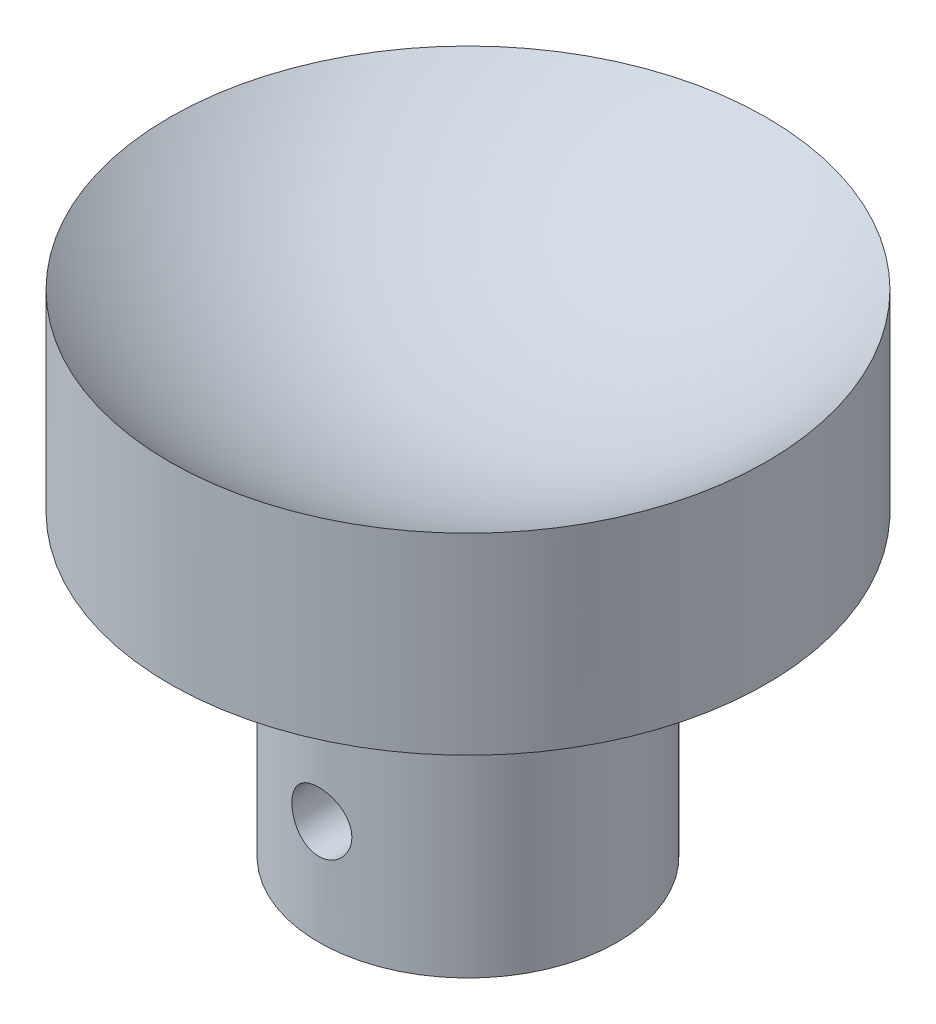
ISO-10303-21;
HEADER;
FILE_DESCRIPTION(('STEP AP214'),'2;1');
FILE_NAME('part.step','',(''),(''),'','','');
FILE_SCHEMA(('AUTOMOTIVE_DESIGN { 1 0 10303 214 1 1 1 1 }'));
ENDSEC;
DATA;
#1=APPLICATION_CONTEXT('core data for automotive mechanical design processes');
#2=APPLICATION_PROTOCOL_DEFINITION('international standard','automotive_design',2000,#1);
#3=PRODUCT_CONTEXT('',#1,'mechanical');
#4=PRODUCT('Part','Part','',(#3));
#5=PRODUCT_RELATED_PRODUCT_CATEGORY('part','',(#4));
#6=PRODUCT_DEFINITION_FORMATION('','',#4);
#7=PRODUCT_DEFINITION_CONTEXT('part definition',#1,'design');
#8=PRODUCT_DEFINITION('design','',#6,#7);
#9=PRODUCT_DEFINITION_SHAPE('','',#8);
#10=(LENGTH_UNIT() NAMED_UNIT(*) SI_UNIT(.MILLI.,.METRE.));
#11=(NAMED_UNIT(*) PLANE_ANGLE_UNIT() SI_UNIT($,.RADIAN.));
#12=(NAMED_UNIT(*) SI_UNIT($,.STERADIAN.) SOLID_ANGLE_UNIT());
#13=UNCERTAINTY_MEASURE_WITH_UNIT(LENGTH_MEASURE(1.E-05),#10,'distance_accuracy_value','');
#14=(GEOMETRIC_REPRESENTATION_CONTEXT(3) GLOBAL_UNCERTAINTY_ASSIGNED_CONTEXT((#13)) GLOBAL_UNIT_ASSIGNED_CONTEXT((#10,
#11,#12)) REPRESENTATION_CONTEXT('',''));
#15=CARTESIAN_POINT('',(0.,0.,0.));
#16=DIRECTION('',(0.,0.,1.));
#17=DIRECTION('',(1.,0.,0.));
#18=AXIS2_PLACEMENT_3D('',#15,#16,#17);
#19=CARTESIAN_POINT('',(0.,43.5513544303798,0.));
#20=DIRECTION('',(0.,1.,0.));
#21=DIRECTION('',(1.,0.,0.));
#22=AXIS2_PLACEMENT_3D('',#19,#20,#21);
#23=SPHERICAL_SURFACE('',#22,37.2013544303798);
#24=CARTESIAN_POINT('',(0.,16.3708325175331,0.));
#25=DIRECTION('',(0.,1.,0.));
#26=DIRECTION('',(-1.,0.,0.));
#27=AXIS2_PLACEMENT_3D('',#24,#25,#26);
#28=CIRCLE('',#27,25.4);
#29=CARTESIAN_POINT('',(-25.4,16.3708325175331,0.));
#30=VERTEX_POINT('',#29);
#31=EDGE_CURVE('E51',#30,#30,#28,.T.);
#32=ORIENTED_EDGE('',*,*,#31,.T.);
#33=EDGE_LOOP('',(#32));
#34=FACE_BOUND('',#33,.T.);
#35=ADVANCED_FACE('F40',(#34),#23,.F.);
#36=CARTESIAN_POINT('',(0.,0.,0.));
#37=DIRECTION('',(0.,1.,0.));
#38=DIRECTION('',(-1.,0.,0.));
#39=AXIS2_PLACEMENT_3D('',#36,#37,#38);
#40=CYLINDRICAL_SURFACE('',#39,25.4);
#41=ORIENTED_EDGE('',*,*,#31,.F.);
#42=EDGE_LOOP('',(#41));
#43=FACE_BOUND('',#42,.T.);
#44=CARTESIAN_POINT('',(0.,0.,0.));
#45=DIRECTION('',(0.,1.,0.));
#46=DIRECTION('',(-1.,0.,0.));
#47=AXIS2_PLACEMENT_3D('',#44,#45,#46);
#48=CIRCLE('',#47,25.4);
#49=CARTESIAN_POINT('',(-25.4,0.,0.));
#50=VERTEX_POINT('',#49);
#51=EDGE_CURVE('E55',#50,#50,#48,.T.);
#52=ORIENTED_EDGE('',*,*,#51,.T.);
#53=EDGE_LOOP('',(#52));
#54=FACE_BOUND('',#53,.T.);
#55=ADVANCED_FACE('F101',(#43,#54),#40,.T.);
#56=CARTESIAN_POINT('',(12.7,0.,0.));
#57=DIRECTION('',(0.,1.,0.));
#58=DIRECTION('',(-1.,0.,0.));
#59=AXIS2_PLACEMENT_3D('',#56,#57,#58);
#60=PLANE('',#59);
#61=ORIENTED_EDGE('',*,*,#51,.F.);
#62=EDGE_LOOP('',(#61));
#63=FACE_BOUND('',#62,.T.);
#64=CARTESIAN_POINT('',(0.,0.,0.));
#65=DIRECTION('',(0.,1.,0.));
#66=DIRECTION('',(-1.,0.,0.));
#67=AXIS2_PLACEMENT_3D('',#64,#65,#66);
#68=CIRCLE('',#67,12.7);
#69=CARTESIAN_POINT('',(-12.7,0.,0.));
#70=VERTEX_POINT('',#69);
#71=EDGE_CURVE('E112',#70,#70,#68,.T.);
#72=ORIENTED_EDGE('',*,*,#71,.T.);
#73=EDGE_LOOP('',(#72));
#74=FACE_BOUND('',#73,.T.);
#75=ADVANCED_FACE('F96',(#63,#74),#60,.F.);
#76=CARTESIAN_POINT('',(0.,0.,0.));
#77=DIRECTION('',(0.,1.,0.));
#78=DIRECTION('',(-1.,0.,0.));
#79=AXIS2_PLACEMENT_3D('',#76,#77,#78);
#80=CYLINDRICAL_SURFACE('',#79,12.7);
#81=CARTESIAN_POINT('',(2.55269999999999,-16.51,-12.4408087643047));
#82=CARTESIAN_POINT('',(2.55269477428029,-16.3681764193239,-12.4408115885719));
#83=CARTESIAN_POINT('',(2.54084064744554,-16.2262871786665,-12.4432602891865));
#84=CARTESIAN_POINT('',(2.49377749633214,-15.9465237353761,-12.4527759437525));
#85=CARTESIAN_POINT('',(2.45854987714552,-15.8086528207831,-12.459846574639));
#86=CARTESIAN_POINT('',(2.36587714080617,-15.5410139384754,-12.477773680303));
#87=CARTESIAN_POINT('',(2.30845423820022,-15.4112380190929,-12.4886263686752));
#88=CARTESIAN_POINT('',(2.1730819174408,-15.1631653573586,-12.5128902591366));
#89=CARTESIAN_POINT('',(2.09513360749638,-15.0448679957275,-12.5263013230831));
#90=CARTESIAN_POINT('',(1.91973643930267,-14.821415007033,-12.5543848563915));
#91=CARTESIAN_POINT('',(1.82205052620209,-14.7164471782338,-12.5690712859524));
#92=CARTESIAN_POINT('',(1.6104632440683,-14.5242726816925,-12.5979279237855));
#93=CARTESIAN_POINT('',(1.49656073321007,-14.4370672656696,-12.6120980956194));
#94=CARTESIAN_POINT('',(1.25452913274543,-14.2821635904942,-12.6384762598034));
#95=CARTESIAN_POINT('',(1.1262835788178,-14.2146439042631,-12.6506658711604));
#96=CARTESIAN_POINT('',(0.859982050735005,-14.1021807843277,-12.6715526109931));
#97=CARTESIAN_POINT('',(0.72192700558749,-14.0572352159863,-12.6802500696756));
#98=CARTESIAN_POINT('',(0.441874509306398,-13.991781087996,-12.69307390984));
#99=CARTESIAN_POINT('',(0.299953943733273,-13.9709553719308,-12.6972595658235));
#100=CARTESIAN_POINT('',(0.0145757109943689,-13.953342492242,-12.7007929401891));
#101=CARTESIAN_POINT('',(-0.128881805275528,-13.9565529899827,-12.7001411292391));
#102=CARTESIAN_POINT('',(-0.411081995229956,-13.9866810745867,-12.6941189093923));
#103=CARTESIAN_POINT('',(-0.549862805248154,-14.013257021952,-12.6888165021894));
#104=CARTESIAN_POINT('',(-0.820954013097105,-14.088819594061,-12.6741656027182));
#105=CARTESIAN_POINT('',(-0.953264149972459,-14.1378071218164,-12.6648169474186));
#106=CARTESIAN_POINT('',(-1.20863148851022,-14.257118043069,-12.6430120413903));
#107=CARTESIAN_POINT('',(-1.3316245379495,-14.3275750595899,-12.630536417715));
#108=CARTESIAN_POINT('',(-1.56416830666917,-14.4877260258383,-12.6038524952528));
#109=CARTESIAN_POINT('',(-1.67371746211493,-14.577422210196,-12.5896439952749));
#110=CARTESIAN_POINT('',(-1.87829141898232,-14.7753788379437,-12.5607682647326));
#111=CARTESIAN_POINT('',(-1.97302660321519,-14.8839382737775,-12.546097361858));
#112=CARTESIAN_POINT('',(-2.14299431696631,-15.1155516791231,-12.5181874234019));
#113=CARTESIAN_POINT('',(-2.21822647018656,-15.2386059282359,-12.5049484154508));
#114=CARTESIAN_POINT('',(-2.34715391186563,-15.4961345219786,-12.4813938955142));
#115=CARTESIAN_POINT('',(-2.40080191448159,-15.6306331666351,-12.4710848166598));
#116=CARTESIAN_POINT('',(-2.4846530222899,-15.9069906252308,-12.4546514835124));
#117=CARTESIAN_POINT('',(-2.51485921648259,-16.0488484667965,-12.4485266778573));
#118=CARTESIAN_POINT('',(-2.55053557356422,-16.3332714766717,-12.4412659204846));
#119=CARTESIAN_POINT('',(-2.55642414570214,-16.4757820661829,-12.4400455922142));
#120=CARTESIAN_POINT('',(-2.54442435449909,-16.7597492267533,-12.4425054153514));
#121=CARTESIAN_POINT('',(-2.5265373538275,-16.9012058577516,-12.4461852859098));
#122=CARTESIAN_POINT('',(-2.46785499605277,-17.1776406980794,-12.4579518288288));
#123=CARTESIAN_POINT('',(-2.42728355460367,-17.3126684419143,-12.4659954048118));
#124=CARTESIAN_POINT('',(-2.3246235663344,-17.5740098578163,-12.4855452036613));
#125=CARTESIAN_POINT('',(-2.26253323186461,-17.7003228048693,-12.4970517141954));
#126=CARTESIAN_POINT('',(-2.11765213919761,-17.9424788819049,-12.522420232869));
#127=CARTESIAN_POINT('',(-2.0345997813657,-18.0581624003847,-12.5363112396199));
#128=CARTESIAN_POINT('',(-1.85050057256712,-18.2741033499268,-12.5648041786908));
#129=CARTESIAN_POINT('',(-1.7494518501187,-18.3743591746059,-12.5794061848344));
#130=CARTESIAN_POINT('',(-1.53034922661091,-18.5581871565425,-12.6079499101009));
#131=CARTESIAN_POINT('',(-1.41205578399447,-18.6414762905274,-12.6218778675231));
#132=CARTESIAN_POINT('',(-1.16291237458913,-18.7869982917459,-12.6472641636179));
#133=CARTESIAN_POINT('',(-1.0320629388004,-18.8492320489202,-12.6587226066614));
#134=CARTESIAN_POINT('',(-0.762262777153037,-18.9504651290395,-12.677820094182));
#135=CARTESIAN_POINT('',(-0.623363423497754,-18.989597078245,-12.6854808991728));
#136=CARTESIAN_POINT('',(-0.340793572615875,-19.0439356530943,-12.6962133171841));
#137=CARTESIAN_POINT('',(-0.197123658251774,-19.0591451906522,-12.6992854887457));
#138=CARTESIAN_POINT('',(0.0882065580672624,-19.0650934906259,-12.7004811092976));
#139=CARTESIAN_POINT('',(0.229857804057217,-19.056257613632,-12.6986905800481));
#140=CARTESIAN_POINT('',(0.509612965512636,-19.0153057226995,-12.69054302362));
#141=CARTESIAN_POINT('',(0.647716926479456,-18.9831900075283,-12.6841860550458));
#142=CARTESIAN_POINT('',(0.916188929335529,-18.8967799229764,-12.6676225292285));
#143=CARTESIAN_POINT('',(1.04657416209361,-18.8425371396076,-12.6574249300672));
#144=CARTESIAN_POINT('',(1.29645345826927,-18.7134666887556,-12.6342776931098));
#145=CARTESIAN_POINT('',(1.41594664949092,-18.6386373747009,-12.6213278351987));
#146=CARTESIAN_POINT('',(1.64275163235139,-18.4690856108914,-12.5938336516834));
#147=CARTESIAN_POINT('',(1.74983342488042,-18.3740591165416,-12.5792667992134));
#148=CARTESIAN_POINT('',(1.94667730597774,-18.1674345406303,-12.5503135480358));
#149=CARTESIAN_POINT('',(2.03643528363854,-18.0558325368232,-12.5359271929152));
#150=CARTESIAN_POINT('',(2.19701377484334,-17.8177653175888,-12.5087910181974));
#151=CARTESIAN_POINT('',(2.26761719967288,-17.6911513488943,-12.4960607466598));
#152=CARTESIAN_POINT('',(2.38643481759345,-17.4276361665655,-12.4739172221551));
#153=CARTESIAN_POINT('',(2.43466925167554,-17.2907443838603,-12.4645009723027));
#154=CARTESIAN_POINT('',(2.49806438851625,-17.0462927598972,-12.4519241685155));
#155=CARTESIAN_POINT('',(2.51851594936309,-16.9401238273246,-12.447781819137));
#156=CARTESIAN_POINT('',(2.54583550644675,-16.7259825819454,-12.4422230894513));
#157=CARTESIAN_POINT('',(2.55270397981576,-16.6180103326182,-12.4408066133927));
#158=CARTESIAN_POINT('',(2.55269999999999,-16.51,-12.4408087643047));
#159=B_SPLINE_CURVE_WITH_KNOTS('',3,(#81,#82,#83,#84,#85,#86,#87,#88,#89,#90,#91,#92,#93,#94,
#95,#96,#97,#98,#99,#100,#101,#102,#103,#104,#105,#106,#107,#108,#109,#110,#111,#112,#113,#114,
#115,#116,#117,#118,#119,#120,#121,#122,#123,#124,#125,#126,#127,#128,#129,#130,#131,#132,#133,
#134,#135,#136,#137,#138,#139,#140,#141,#142,#143,#144,#145,#146,#147,#148,#149,#150,#151,#152,
#153,#154,#155,#156,#157,#158),.UNSPECIFIED.,.T.,.F.,(4,2,2,2,2,2,2,2,2,2,2,2,2,2,2,2,2,2,2,2,2,
2,2,2,2,2,2,2,2,2,2,2,2,2,2,2,2,2,4),(0.,0.425075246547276,0.850489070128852,1.27547820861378,
1.70044440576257,2.13085548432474,2.56129688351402,2.9955293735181,3.42972079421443,
3.85813570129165,4.28650892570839,4.70872092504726,5.13094993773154,5.55586246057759,
5.98082436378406,6.41326685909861,6.84571769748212,7.27911084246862,7.71244686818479,
8.13829502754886,8.56411878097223,8.98581164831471,9.40753955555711,9.83481596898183,
10.2621368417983,10.6960885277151,11.1300218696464,11.5614391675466,11.9928039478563,
12.4165877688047,12.8403661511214,13.2631621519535,13.6859919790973,14.1157058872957,
14.5455216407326,14.9800225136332,15.4141294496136,15.7378706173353,16.061600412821),.UNSPECIFIED.);
#160=CARTESIAN_POINT('',(2.55269999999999,-16.51,-12.4408087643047));
#161=VERTEX_POINT('',#160);
#162=EDGE_CURVE('E43',#161,#161,#159,.T.);
#163=ORIENTED_EDGE('',*,*,#162,.T.);
#164=EDGE_LOOP('',(#163));
#165=FACE_BOUND('',#164,.T.);
#166=CARTESIAN_POINT('',(2.55269999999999,-16.51,12.4408087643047));
#167=CARTESIAN_POINT('',(2.55269477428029,-16.6518235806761,12.4408115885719));
#168=CARTESIAN_POINT('',(2.54084064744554,-16.7937128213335,12.4432602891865));
#169=CARTESIAN_POINT('',(2.49377749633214,-17.0734762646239,12.4527759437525));
#170=CARTESIAN_POINT('',(2.45854987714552,-17.2113471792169,12.459846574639));
#171=CARTESIAN_POINT('',(2.36587714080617,-17.4789860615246,12.477773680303));
#172=CARTESIAN_POINT('',(2.30845423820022,-17.6087619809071,12.4886263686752));
#173=CARTESIAN_POINT('',(2.1730819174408,-17.8568346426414,12.5128902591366));
#174=CARTESIAN_POINT('',(2.09513360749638,-17.9751320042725,12.5263013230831));
#175=CARTESIAN_POINT('',(1.91973643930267,-18.198584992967,12.5543848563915));
#176=CARTESIAN_POINT('',(1.82205052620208,-18.3035528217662,12.5690712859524));
#177=CARTESIAN_POINT('',(1.6104632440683,-18.4957273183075,12.5979279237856));
#178=CARTESIAN_POINT('',(1.49656073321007,-18.5829327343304,12.6120980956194));
#179=CARTESIAN_POINT('',(1.25452913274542,-18.7378364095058,12.6384762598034));
#180=CARTESIAN_POINT('',(1.1262835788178,-18.8053560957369,12.6506658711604));
#181=CARTESIAN_POINT('',(0.859982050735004,-18.9178192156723,12.6715526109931));
#182=CARTESIAN_POINT('',(0.721927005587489,-18.9627647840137,12.6802500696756));
#183=CARTESIAN_POINT('',(0.441874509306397,-19.028218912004,12.69307390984));
#184=CARTESIAN_POINT('',(0.299953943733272,-19.0490446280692,12.6972595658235));
#185=CARTESIAN_POINT('',(0.0145757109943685,-19.066657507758,12.7007929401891));
#186=CARTESIAN_POINT('',(-0.128881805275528,-19.0634470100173,12.7001411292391));
#187=CARTESIAN_POINT('',(-0.411081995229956,-19.0333189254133,12.6941189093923));
#188=CARTESIAN_POINT('',(-0.549862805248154,-19.006742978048,12.6888165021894));
#189=CARTESIAN_POINT('',(-0.820954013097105,-18.931180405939,12.6741656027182));
#190=CARTESIAN_POINT('',(-0.953264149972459,-18.8821928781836,12.6648169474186));
#191=CARTESIAN_POINT('',(-1.20863148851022,-18.762881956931,12.6430120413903));
#192=CARTESIAN_POINT('',(-1.3316245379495,-18.6924249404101,12.630536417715));
#193=CARTESIAN_POINT('',(-1.56416830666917,-18.5322739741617,12.6038524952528));
#194=CARTESIAN_POINT('',(-1.67371746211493,-18.442577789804,12.5896439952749));
#195=CARTESIAN_POINT('',(-1.87829141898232,-18.2446211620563,12.5607682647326));
#196=CARTESIAN_POINT('',(-1.97302660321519,-18.1360617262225,12.546097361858));
#197=CARTESIAN_POINT('',(-2.1429943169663,-17.9044483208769,12.5181874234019));
#198=CARTESIAN_POINT('',(-2.21822647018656,-17.7813940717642,12.5049484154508));
#199=CARTESIAN_POINT('',(-2.34715391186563,-17.5238654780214,12.4813938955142));
#200=CARTESIAN_POINT('',(-2.40080191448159,-17.3893668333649,12.4710848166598));
#201=CARTESIAN_POINT('',(-2.4846530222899,-17.1130093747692,12.4546514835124));
#202=CARTESIAN_POINT('',(-2.51485921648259,-16.9711515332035,12.4485266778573));
#203=CARTESIAN_POINT('',(-2.55053557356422,-16.6867285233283,12.4412659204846));
#204=CARTESIAN_POINT('',(-2.55642414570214,-16.5442179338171,12.4400455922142));
#205=CARTESIAN_POINT('',(-2.54442435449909,-16.2602507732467,12.4425054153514));
#206=CARTESIAN_POINT('',(-2.5265373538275,-16.1187941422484,12.4461852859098));
#207=CARTESIAN_POINT('',(-2.46785499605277,-15.8423593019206,12.4579518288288));
#208=CARTESIAN_POINT('',(-2.42728355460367,-15.7073315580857,12.4659954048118));
#209=CARTESIAN_POINT('',(-2.3246235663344,-15.4459901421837,12.4855452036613));
#210=CARTESIAN_POINT('',(-2.26253323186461,-15.3196771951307,12.4970517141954));
#211=CARTESIAN_POINT('',(-2.11765213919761,-15.0775211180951,12.522420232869));
#212=CARTESIAN_POINT('',(-2.0345997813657,-14.9618375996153,12.5363112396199));
#213=CARTESIAN_POINT('',(-1.85050057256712,-14.7458966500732,12.5648041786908));
#214=CARTESIAN_POINT('',(-1.7494518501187,-14.6456408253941,12.5794061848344));
#215=CARTESIAN_POINT('',(-1.53034922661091,-14.4618128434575,12.6079499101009));
#216=CARTESIAN_POINT('',(-1.41205578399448,-14.3785237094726,12.6218778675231));
#217=CARTESIAN_POINT('',(-1.16291237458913,-14.2330017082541,12.6472641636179));
#218=CARTESIAN_POINT('',(-1.0320629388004,-14.1707679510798,12.6587226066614));
#219=CARTESIAN_POINT('',(-0.762262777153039,-14.0695348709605,12.677820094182));
#220=CARTESIAN_POINT('',(-0.623363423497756,-14.030402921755,12.6854808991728));
#221=CARTESIAN_POINT('',(-0.340793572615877,-13.9760643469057,12.6962133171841));
#222=CARTESIAN_POINT('',(-0.197123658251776,-13.9608548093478,12.6992854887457));
#223=CARTESIAN_POINT('',(0.0882065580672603,-13.9549065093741,12.7004811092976));
#224=CARTESIAN_POINT('',(0.229857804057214,-13.963742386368,12.6986905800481));
#225=CARTESIAN_POINT('',(0.509612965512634,-14.0046942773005,12.69054302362));
#226=CARTESIAN_POINT('',(0.647716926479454,-14.0368099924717,12.6841860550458));
#227=CARTESIAN_POINT('',(0.916188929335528,-14.1232200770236,12.6676225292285));
#228=CARTESIAN_POINT('',(1.04657416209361,-14.1774628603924,12.6574249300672));
#229=CARTESIAN_POINT('',(1.29645345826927,-14.3065333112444,12.6342776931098));
#230=CARTESIAN_POINT('',(1.41594664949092,-14.3813626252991,12.6213278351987));
#231=CARTESIAN_POINT('',(1.64275163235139,-14.5509143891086,12.5938336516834));
#232=CARTESIAN_POINT('',(1.74983342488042,-14.6459408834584,12.5792667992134));
#233=CARTESIAN_POINT('',(1.94667730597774,-14.8525654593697,12.5503135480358));
#234=CARTESIAN_POINT('',(2.03643528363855,-14.9641674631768,12.5359271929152));
#235=CARTESIAN_POINT('',(2.19701377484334,-15.2022346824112,12.5087910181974));
#236=CARTESIAN_POINT('',(2.26761719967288,-15.3288486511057,12.4960607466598));
#237=CARTESIAN_POINT('',(2.38643481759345,-15.5923638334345,12.4739172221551));
#238=CARTESIAN_POINT('',(2.43466925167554,-15.7292556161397,12.4645009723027));
#239=CARTESIAN_POINT('',(2.49806438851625,-15.9737072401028,12.4519241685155));
#240=CARTESIAN_POINT('',(2.51851594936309,-16.0798761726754,12.447781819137));
#241=CARTESIAN_POINT('',(2.54583550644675,-16.2940174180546,12.4422230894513));
#242=CARTESIAN_POINT('',(2.55270397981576,-16.4019896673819,12.4408066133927));
#243=CARTESIAN_POINT('',(2.55269999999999,-16.51,12.4408087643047));
#244=B_SPLINE_CURVE_WITH_KNOTS('',3,(#166,#167,#168,#169,#170,#171,#172,#173,#174,#175,#176,
#177,#178,#179,#180,#181,#182,#183,#184,#185,#186,#187,#188,#189,#190,#191,#192,#193,#194,#195,
#196,#197,#198,#199,#200,#201,#202,#203,#204,#205,#206,#207,#208,#209,#210,#211,#212,#213,#214,
#215,#216,#217,#218,#219,#220,#221,#222,#223,#224,#225,#226,#227,#228,#229,#230,#231,#232,#233,
#234,#235,#236,#237,#238,#239,#240,#241,#242,#243),.UNSPECIFIED.,.T.,.F.,(4,2,2,2,2,2,2,2,2,2,2,
2,2,2,2,2,2,2,2,2,2,2,2,2,2,2,2,2,2,2,2,2,2,2,2,2,2,2,4),(0.,0.425075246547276,
0.850489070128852,1.27547820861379,1.70044440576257,2.13085548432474,2.56129688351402,
2.9955293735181,3.42972079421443,3.85813570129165,4.28650892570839,4.70872092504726,
5.13094993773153,5.55586246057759,5.98082436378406,6.41326685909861,6.84571769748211,
7.27911084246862,7.71244686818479,8.13829502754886,8.56411878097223,8.98581164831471,
9.40753955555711,9.83481596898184,10.2621368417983,10.6960885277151,11.1300218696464,
11.5614391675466,11.9928039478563,12.4165877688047,12.8403661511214,13.2631621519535,
13.6859919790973,14.1157058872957,14.5455216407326,14.9800225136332,15.4141294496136,
15.7378706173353,16.061600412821),.UNSPECIFIED.);
#245=CARTESIAN_POINT('',(2.55269999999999,-16.51,12.4408087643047));
#246=VERTEX_POINT('',#245);
#247=EDGE_CURVE('E12',#246,#246,#244,.T.);
#248=ORIENTED_EDGE('',*,*,#247,.T.);
#249=EDGE_LOOP('',(#248));
#250=FACE_BOUND('',#249,.T.);
#251=ORIENTED_EDGE('',*,*,#71,.F.);
#252=EDGE_LOOP('',(#251));
#253=FACE_BOUND('',#252,.T.);
#254=CARTESIAN_POINT('',(0.,-25.4,0.));
#255=DIRECTION('',(0.,1.,0.));
#256=DIRECTION('',(-1.,0.,0.));
#257=AXIS2_PLACEMENT_3D('',#254,#255,#256);
#258=CIRCLE('',#257,12.7);
#259=CARTESIAN_POINT('',(-12.7,-25.4,0.));
#260=VERTEX_POINT('',#259);
#261=EDGE_CURVE('E114',#260,#260,#258,.T.);
#262=ORIENTED_EDGE('',*,*,#261,.T.);
#263=EDGE_LOOP('',(#262));
#264=FACE_BOUND('',#263,.T.);
#265=ADVANCED_FACE('F60',(#165,#250,#253,#264),#80,.T.);
#266=CARTESIAN_POINT('',(0.,-25.4,0.));
#267=DIRECTION('',(0.,1.,0.));
#268=DIRECTION('',(-1.,0.,0.));
#269=AXIS2_PLACEMENT_3D('',#266,#267,#268);
#270=PLANE('',#269);
#271=CARTESIAN_POINT('',(0.,-25.4,0.));
#272=DIRECTION('',(0.,-1.,0.));
#273=DIRECTION('',(1.,0.,0.));
#274=AXIS2_PLACEMENT_3D('',#271,#272,#273);
#275=CIRCLE('',#274,7.14375);
#276=CARTESIAN_POINT('',(7.14375,-25.4,0.));
#277=VERTEX_POINT('',#276);
#278=EDGE_CURVE('E120',#277,#277,#275,.T.);
#279=ORIENTED_EDGE('',*,*,#278,.F.);
#280=EDGE_LOOP('',(#279));
#281=FACE_BOUND('',#280,.T.);
#282=ORIENTED_EDGE('',*,*,#261,.F.);
#283=EDGE_LOOP('',(#282));
#284=FACE_BOUND('',#283,.T.);
#285=ADVANCED_FACE('F88',(#281,#284),#270,.F.);
#286=CARTESIAN_POINT('',(0.,-10.16,0.));
#287=DIRECTION('',(0.,-1.,0.));
#288=DIRECTION('',(1.,0.,0.));
#289=AXIS2_PLACEMENT_3D('',#286,#287,#288);
#290=CYLINDRICAL_SURFACE('',#289,7.14375);
#291=CARTESIAN_POINT('',(2.55269999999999,-16.51,-6.67209762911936));
#292=CARTESIAN_POINT('',(2.55270301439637,-16.6483785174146,-6.67209498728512));
#293=CARTESIAN_POINT('',(2.54141029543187,-16.7867362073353,-6.67644946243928));
#294=CARTESIAN_POINT('',(2.49671976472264,-17.059311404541,-6.69328882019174));
#295=CARTESIAN_POINT('',(2.46332088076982,-17.1935287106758,-6.7057740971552));
#296=CARTESIAN_POINT('',(2.37577435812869,-17.4538208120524,-6.73728409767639));
#297=CARTESIAN_POINT('',(2.32167239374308,-17.5799128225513,-6.75629441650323));
#298=CARTESIAN_POINT('',(2.1944149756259,-17.8212768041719,-6.79869031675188));
#299=CARTESIAN_POINT('',(2.12125440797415,-17.9365458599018,-6.82207707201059));
#300=CARTESIAN_POINT('',(1.95442617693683,-18.1581846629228,-6.8717717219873));
#301=CARTESIAN_POINT('',(1.86004160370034,-18.2639969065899,-6.89816000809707));
#302=CARTESIAN_POINT('',(1.65496957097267,-18.4586785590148,-6.95021002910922));
#303=CARTESIAN_POINT('',(1.5442790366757,-18.5475447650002,-6.97587162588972));
#304=CARTESIAN_POINT('',(1.30557329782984,-18.708428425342,-7.02452157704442));
#305=CARTESIAN_POINT('',(1.17713271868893,-18.779849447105,-7.04740454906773));
#306=CARTESIAN_POINT('',(0.909099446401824,-18.8998441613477,-7.08696107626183));
#307=CARTESIAN_POINT('',(0.769510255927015,-18.9484249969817,-7.10363657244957));
#308=CARTESIAN_POINT('',(0.48899658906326,-19.0194335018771,-7.12832918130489));
#309=CARTESIAN_POINT('',(0.348342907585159,-19.0428188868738,-7.13666243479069));
#310=CARTESIAN_POINT('',(0.0648772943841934,-19.0658310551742,-7.14486077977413));
#311=CARTESIAN_POINT('',(-0.0779339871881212,-19.0654648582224,-7.14472837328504));
#312=CARTESIAN_POINT('',(-0.354834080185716,-19.0415638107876,-7.13621719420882));
#313=CARTESIAN_POINT('',(-0.489026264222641,-19.0190719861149,-7.12820966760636));
#314=CARTESIAN_POINT('',(-0.751588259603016,-18.953299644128,-7.10532579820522));
#315=CARTESIAN_POINT('',(-0.879957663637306,-18.9100176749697,-7.09044897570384));
#316=CARTESIAN_POINT('',(-1.12935941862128,-18.8033561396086,-7.05505577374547));
#317=CARTESIAN_POINT('',(-1.25026357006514,-18.7397031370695,-7.03446320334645));
#318=CARTESIAN_POINT('',(-1.47996281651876,-18.5943405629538,-6.98974872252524));
#319=CARTESIAN_POINT('',(-1.58875420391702,-18.512625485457,-6.96562573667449));
#320=CARTESIAN_POINT('',(-1.79731427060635,-18.3283301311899,-6.91483638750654));
#321=CARTESIAN_POINT('',(-1.89628723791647,-18.224866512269,-6.88810300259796));
#322=CARTESIAN_POINT('',(-2.07575926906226,-18.0026178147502,-6.83616392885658));
#323=CARTESIAN_POINT('',(-2.15625453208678,-17.8838295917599,-6.81095855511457));
#324=CARTESIAN_POINT('',(-2.29781749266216,-17.6314375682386,-6.76453043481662));
#325=CARTESIAN_POINT('',(-2.35849780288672,-17.4976001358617,-6.74339008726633));
#326=CARTESIAN_POINT('',(-2.45617122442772,-17.220655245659,-6.7084357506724));
#327=CARTESIAN_POINT('',(-2.49317606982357,-17.0775524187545,-6.69461813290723));
#328=CARTESIAN_POINT('',(-2.54072176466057,-16.7939391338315,-6.67671426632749));
#329=CARTESIAN_POINT('',(-2.55251394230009,-16.6536675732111,-6.67216842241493));
#330=CARTESIAN_POINT('',(-2.55288156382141,-16.3731066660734,-6.67202855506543));
#331=CARTESIAN_POINT('',(-2.54146207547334,-16.2328173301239,-6.67643257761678));
#332=CARTESIAN_POINT('',(-2.49686106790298,-15.9622938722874,-6.69323306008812));
#333=CARTESIAN_POINT('',(-2.46460274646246,-15.8318841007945,-6.70529009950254));
#334=CARTESIAN_POINT('',(-2.38037760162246,-15.5783722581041,-6.73564817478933));
#335=CARTESIAN_POINT('',(-2.32840697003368,-15.4552716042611,-6.75395041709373));
#336=CARTESIAN_POINT('',(-2.20416960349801,-15.2150729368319,-6.79552963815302));
#337=CARTESIAN_POINT('',(-2.13125428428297,-15.0983374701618,-6.818958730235));
#338=CARTESIAN_POINT('',(-1.9679065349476,-14.8783108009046,-6.86787935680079));
#339=CARTESIAN_POINT('',(-1.8774682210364,-14.7750241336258,-6.89337158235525));
#340=CARTESIAN_POINT('',(-1.67557640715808,-14.5787731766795,-6.94529022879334));
#341=CARTESIAN_POINT('',(-1.56322329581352,-14.4867237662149,-6.9716878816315));
#342=CARTESIAN_POINT('',(-1.32401351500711,-14.3226975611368,-7.02104308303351));
#343=CARTESIAN_POINT('',(-1.19715708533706,-14.2507204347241,-7.04400068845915));
#344=CARTESIAN_POINT('',(-0.932900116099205,-14.1294556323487,-7.08382693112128));
#345=CARTESIAN_POINT('',(-0.795556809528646,-14.0800538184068,-7.10072610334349));
#346=CARTESIAN_POINT('',(-0.513776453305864,-14.0052977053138,-7.1266525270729));
#347=CARTESIAN_POINT('',(-0.369342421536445,-13.97993326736,-7.13568309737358));
#348=CARTESIAN_POINT('',(-0.0857906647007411,-13.9549882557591,-7.1445679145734));
#349=CARTESIAN_POINT('',(0.0531988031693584,-13.9541025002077,-7.14488665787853));
#350=CARTESIAN_POINT('',(0.329255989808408,-13.9748428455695,-7.13749355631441));
#351=CARTESIAN_POINT('',(0.466323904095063,-13.9964666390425,-7.1297825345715));
#352=CARTESIAN_POINT('',(0.731816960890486,-14.060714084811,-7.10739139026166));
#353=CARTESIAN_POINT('',(0.860361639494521,-14.102898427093,-7.09285728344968));
#354=CARTESIAN_POINT('',(1.10857796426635,-14.2066466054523,-7.05832404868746));
#355=CARTESIAN_POINT('',(1.22824794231,-14.2682140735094,-7.03832389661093));
#356=CARTESIAN_POINT('',(1.46055943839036,-14.411802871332,-6.99388881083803));
#357=CARTESIAN_POINT('',(1.57272716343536,-14.4945449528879,-6.96930828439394));
#358=CARTESIAN_POINT('',(1.78200020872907,-14.6769600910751,-6.9187607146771));
#359=CARTESIAN_POINT('',(1.87910035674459,-14.7766389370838,-6.89279319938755));
#360=CARTESIAN_POINT('',(2.06013138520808,-14.9956535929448,-6.84092913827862));
#361=CARTESIAN_POINT('',(2.14323420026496,-15.1156905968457,-6.81509268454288));
#362=CARTESIAN_POINT('',(2.28807806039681,-15.368844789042,-6.76784248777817));
#363=CARTESIAN_POINT('',(2.34982051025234,-15.5019611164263,-6.74642845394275));
#364=CARTESIAN_POINT('',(2.45002781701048,-15.7783361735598,-6.71069280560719));
#365=CARTESIAN_POINT('',(2.48838551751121,-15.9216382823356,-6.69640389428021));
#366=CARTESIAN_POINT('',(2.53971360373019,-16.2133032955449,-6.67711005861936));
#367=CARTESIAN_POINT('',(2.55269676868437,-16.361663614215,-6.67210046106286));
#368=CARTESIAN_POINT('',(2.55269999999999,-16.51,-6.67209762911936));
#369=B_SPLINE_CURVE_WITH_KNOTS('',3,(#291,#292,#293,#294,#295,#296,#297,#298,#299,#300,#301,
#302,#303,#304,#305,#306,#307,#308,#309,#310,#311,#312,#313,#314,#315,#316,#317,#318,#319,#320,
#321,#322,#323,#324,#325,#326,#327,#328,#329,#330,#331,#332,#333,#334,#335,#336,#337,#338,#339,
#340,#341,#342,#343,#344,#345,#346,#347,#348,#349,#350,#351,#352,#353,#354,#355,#356,#357,#358,
#359,#360,#361,#362,#363,#364,#365,#366,#367,#368),.UNSPECIFIED.,.T.,.F.,(4,2,2,2,2,2,2,2,2,2,2,
2,2,2,2,2,2,2,2,2,2,2,2,2,2,2,2,2,2,2,2,2,2,2,2,2,2,2,4),(0.,0.414584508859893,
0.829189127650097,1.24288428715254,1.65669056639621,2.08743729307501,2.51826534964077,
2.96223129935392,3.40605830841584,3.83234492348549,4.25850555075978,4.66549455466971,
5.07251198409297,5.48523958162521,5.89809316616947,6.33306655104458,6.76812932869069,
7.21124907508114,7.65414903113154,8.07450180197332,8.49476280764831,8.89757546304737,
9.30046597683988,9.71750325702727,10.1346808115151,10.5754658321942,11.0162435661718,
11.4547674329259,11.8931062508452,12.3080253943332,12.7229020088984,13.1292788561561,
13.5357318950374,13.9584719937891,14.3813568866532,14.824015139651,15.2666442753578,
15.7112867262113,16.1557051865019),.UNSPECIFIED.);
#370=CARTESIAN_POINT('',(2.55269999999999,-16.51,-6.67209762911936));
#371=VERTEX_POINT('',#370);
#372=EDGE_CURVE('E81',#371,#371,#369,.T.);
#373=ORIENTED_EDGE('',*,*,#372,.T.);
#374=EDGE_LOOP('',(#373));
#375=FACE_BOUND('',#374,.T.);
#376=CARTESIAN_POINT('',(2.55269999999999,-16.51,6.67209762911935));
#377=CARTESIAN_POINT('',(2.55270301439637,-16.3716214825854,6.67209498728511));
#378=CARTESIAN_POINT('',(2.54141029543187,-16.2332637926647,6.67644946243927));
#379=CARTESIAN_POINT('',(2.49671976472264,-15.960688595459,6.69328882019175));
#380=CARTESIAN_POINT('',(2.46332088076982,-15.8264712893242,6.7057740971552));
#381=CARTESIAN_POINT('',(2.37577435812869,-15.5661791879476,6.73728409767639));
#382=CARTESIAN_POINT('',(2.32167239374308,-15.4400871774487,6.75629441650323));
#383=CARTESIAN_POINT('',(2.1944149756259,-15.1987231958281,6.79869031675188));
#384=CARTESIAN_POINT('',(2.12125440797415,-15.0834541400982,6.82207707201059));
#385=CARTESIAN_POINT('',(1.95442617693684,-14.8618153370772,6.8717717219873));
#386=CARTESIAN_POINT('',(1.86004160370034,-14.7560030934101,6.89816000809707));
#387=CARTESIAN_POINT('',(1.65496957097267,-14.5613214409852,6.95021002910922));
#388=CARTESIAN_POINT('',(1.5442790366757,-14.4724552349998,6.97587162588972));
#389=CARTESIAN_POINT('',(1.30557329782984,-14.311571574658,7.02452157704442));
#390=CARTESIAN_POINT('',(1.17713271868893,-14.240150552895,7.04740454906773));
#391=CARTESIAN_POINT('',(0.909099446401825,-14.1201558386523,7.08696107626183));
#392=CARTESIAN_POINT('',(0.769510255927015,-14.0715750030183,7.10363657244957));
#393=CARTESIAN_POINT('',(0.48899658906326,-14.0005664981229,7.12832918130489));
#394=CARTESIAN_POINT('',(0.348342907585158,-13.9771811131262,7.13666243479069));
#395=CARTESIAN_POINT('',(0.0648772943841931,-13.9541689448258,7.14486077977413));
#396=CARTESIAN_POINT('',(-0.0779339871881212,-13.9545351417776,7.14472837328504));
#397=CARTESIAN_POINT('',(-0.354834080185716,-13.9784361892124,7.13621719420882));
#398=CARTESIAN_POINT('',(-0.489026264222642,-14.0009280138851,7.12820966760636));
#399=CARTESIAN_POINT('',(-0.751588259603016,-14.066700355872,7.10532579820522));
#400=CARTESIAN_POINT('',(-0.879957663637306,-14.1099823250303,7.09044897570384));
#401=CARTESIAN_POINT('',(-1.12935941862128,-14.2166438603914,7.05505577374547));
#402=CARTESIAN_POINT('',(-1.25026357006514,-14.2802968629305,7.03446320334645));
#403=CARTESIAN_POINT('',(-1.47996281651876,-14.4256594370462,6.98974872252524));
#404=CARTESIAN_POINT('',(-1.58875420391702,-14.507374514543,6.96562573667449));
#405=CARTESIAN_POINT('',(-1.79731427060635,-14.6916698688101,6.91483638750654));
#406=CARTESIAN_POINT('',(-1.89628723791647,-14.795133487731,6.88810300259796));
#407=CARTESIAN_POINT('',(-2.07575926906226,-15.0173821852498,6.83616392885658));
#408=CARTESIAN_POINT('',(-2.15625453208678,-15.1361704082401,6.81095855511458));
#409=CARTESIAN_POINT('',(-2.29781749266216,-15.3885624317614,6.76453043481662));
#410=CARTESIAN_POINT('',(-2.35849780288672,-15.5223998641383,6.74339008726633));
#411=CARTESIAN_POINT('',(-2.45617122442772,-15.799344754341,6.7084357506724));
#412=CARTESIAN_POINT('',(-2.49317606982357,-15.9424475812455,6.69461813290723));
#413=CARTESIAN_POINT('',(-2.54072176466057,-16.2260608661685,6.67671426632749));
#414=CARTESIAN_POINT('',(-2.55251394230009,-16.3663324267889,6.67216842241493));
#415=CARTESIAN_POINT('',(-2.55288156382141,-16.6468933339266,6.67202855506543));
#416=CARTESIAN_POINT('',(-2.54146207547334,-16.7871826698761,6.67643257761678));
#417=CARTESIAN_POINT('',(-2.49686106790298,-17.0577061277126,6.69323306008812));
#418=CARTESIAN_POINT('',(-2.46460274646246,-17.1881158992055,6.70529009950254));
#419=CARTESIAN_POINT('',(-2.38037760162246,-17.4416277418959,6.73564817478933));
#420=CARTESIAN_POINT('',(-2.32840697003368,-17.5647283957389,6.75395041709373));
#421=CARTESIAN_POINT('',(-2.20416960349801,-17.8049270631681,6.79552963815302));
#422=CARTESIAN_POINT('',(-2.13125428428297,-17.9216625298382,6.818958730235));
#423=CARTESIAN_POINT('',(-1.9679065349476,-18.1416891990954,6.86787935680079));
#424=CARTESIAN_POINT('',(-1.8774682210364,-18.2449758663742,6.89337158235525));
#425=CARTESIAN_POINT('',(-1.67557640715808,-18.4412268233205,6.94529022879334));
#426=CARTESIAN_POINT('',(-1.56322329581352,-18.5332762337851,6.9716878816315));
#427=CARTESIAN_POINT('',(-1.32401351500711,-18.6973024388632,7.02104308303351));
#428=CARTESIAN_POINT('',(-1.19715708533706,-18.7692795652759,7.04400068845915));
#429=CARTESIAN_POINT('',(-0.932900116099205,-18.8905443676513,7.08382693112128));
#430=CARTESIAN_POINT('',(-0.795556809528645,-18.9399461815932,7.10072610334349));
#431=CARTESIAN_POINT('',(-0.513776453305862,-19.0147022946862,7.1266525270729));
#432=CARTESIAN_POINT('',(-0.369342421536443,-19.04006673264,7.13568309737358));
#433=CARTESIAN_POINT('',(-0.0857906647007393,-19.0650117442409,7.1445679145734));
#434=CARTESIAN_POINT('',(0.0531988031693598,-19.0658974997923,7.14488665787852));
#435=CARTESIAN_POINT('',(0.329255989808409,-19.0451571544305,7.13749355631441));
#436=CARTESIAN_POINT('',(0.466323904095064,-19.0235333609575,7.1297825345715));
#437=CARTESIAN_POINT('',(0.731816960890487,-18.959285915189,7.10739139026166));
#438=CARTESIAN_POINT('',(0.860361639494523,-18.917101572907,7.09285728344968));
#439=CARTESIAN_POINT('',(1.10857796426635,-18.8133533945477,7.05832404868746));
#440=CARTESIAN_POINT('',(1.22824794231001,-18.7517859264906,7.03832389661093));
#441=CARTESIAN_POINT('',(1.46055943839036,-18.608197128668,6.99388881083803));
#442=CARTESIAN_POINT('',(1.57272716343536,-18.5254550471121,6.96930828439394));
#443=CARTESIAN_POINT('',(1.78200020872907,-18.3430399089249,6.9187607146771));
#444=CARTESIAN_POINT('',(1.87910035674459,-18.2433610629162,6.89279319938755));
#445=CARTESIAN_POINT('',(2.06013138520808,-18.0243464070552,6.84092913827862));
#446=CARTESIAN_POINT('',(2.14323420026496,-17.9043094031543,6.81509268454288));
#447=CARTESIAN_POINT('',(2.28807806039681,-17.651155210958,6.76784248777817));
#448=CARTESIAN_POINT('',(2.34982051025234,-17.5180388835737,6.74642845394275));
#449=CARTESIAN_POINT('',(2.45002781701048,-17.2416638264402,6.71069280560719));
#450=CARTESIAN_POINT('',(2.48838551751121,-17.0983617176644,6.69640389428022));
#451=CARTESIAN_POINT('',(2.53971360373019,-16.8066967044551,6.67711005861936));
#452=CARTESIAN_POINT('',(2.55269676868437,-16.658336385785,6.67210046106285));
#453=CARTESIAN_POINT('',(2.55269999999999,-16.51,6.67209762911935));
#454=B_SPLINE_CURVE_WITH_KNOTS('',3,(#376,#377,#378,#379,#380,#381,#382,#383,#384,#385,#386,
#387,#388,#389,#390,#391,#392,#393,#394,#395,#396,#397,#398,#399,#400,#401,#402,#403,#404,#405,
#406,#407,#408,#409,#410,#411,#412,#413,#414,#415,#416,#417,#418,#419,#420,#421,#422,#423,#424,
#425,#426,#427,#428,#429,#430,#431,#432,#433,#434,#435,#436,#437,#438,#439,#440,#441,#442,#443,
#444,#445,#446,#447,#448,#449,#450,#451,#452,#453),.UNSPECIFIED.,.T.,.F.,(4,2,2,2,2,2,2,2,2,2,2,
2,2,2,2,2,2,2,2,2,2,2,2,2,2,2,2,2,2,2,2,2,2,2,2,2,2,2,4),(0.,0.414584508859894,
0.829189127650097,1.24288428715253,1.65669056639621,2.08743729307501,2.51826534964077,
2.96223129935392,3.40605830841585,3.83234492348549,4.25850555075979,4.66549455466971,
5.07251198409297,5.48523958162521,5.89809316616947,6.33306655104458,6.76812932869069,
7.21124907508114,7.65414903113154,8.07450180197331,8.49476280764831,8.89757546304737,
9.30046597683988,9.71750325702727,10.1346808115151,10.5754658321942,11.0162435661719,
11.4547674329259,11.8931062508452,12.3080253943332,12.7229020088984,13.1292788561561,
13.5357318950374,13.9584719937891,14.3813568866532,14.824015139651,15.2666442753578,
15.7112867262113,16.1557051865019),.UNSPECIFIED.);
#455=CARTESIAN_POINT('',(2.55269999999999,-16.51,6.67209762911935));
#456=VERTEX_POINT('',#455);
#457=EDGE_CURVE('E77',#456,#456,#454,.T.);
#458=ORIENTED_EDGE('',*,*,#457,.T.);
#459=EDGE_LOOP('',(#458));
#460=FACE_BOUND('',#459,.T.);
#461=CARTESIAN_POINT('',(0.,-10.16,0.));
#462=DIRECTION('',(0.,-1.,0.));
#463=DIRECTION('',(1.,0.,0.));
#464=AXIS2_PLACEMENT_3D('',#461,#462,#463);
#465=CIRCLE('',#464,7.14375);
#466=CARTESIAN_POINT('',(7.14375,-10.16,0.));
#467=VERTEX_POINT('',#466);
#468=EDGE_CURVE('E119',#467,#467,#465,.T.);
#469=ORIENTED_EDGE('',*,*,#468,.F.);
#470=EDGE_LOOP('',(#469));
#471=FACE_BOUND('',#470,.T.);
#472=ORIENTED_EDGE('',*,*,#278,.T.);
#473=EDGE_LOOP('',(#472));
#474=FACE_BOUND('',#473,.T.);
#475=ADVANCED_FACE('F85',(#375,#460,#471,#474),#290,.F.);
#476=CARTESIAN_POINT('',(0.,-10.16,0.));
#477=DIRECTION('',(0.,-1.,0.));
#478=DIRECTION('',(1.,0.,0.));
#479=AXIS2_PLACEMENT_3D('',#476,#477,#478);
#480=PLANE('',#479);
#481=ORIENTED_EDGE('',*,*,#468,.T.);
#482=EDGE_LOOP('',(#481));
#483=FACE_BOUND('',#482,.T.);
#484=ADVANCED_FACE('F70',(#483),#480,.T.);
#485=CARTESIAN_POINT('',(0.,-16.51,12.7));
#486=DIRECTION('',(0.,0.,1.));
#487=DIRECTION('',(1.,0.,0.));
#488=AXIS2_PLACEMENT_3D('',#485,#486,#487);
#489=CYLINDRICAL_SURFACE('',#488,2.55269999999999);
#490=ORIENTED_EDGE('',*,*,#247,.F.);
#491=EDGE_LOOP('',(#490));
#492=FACE_BOUND('',#491,.T.);
#493=ORIENTED_EDGE('',*,*,#457,.F.);
#494=EDGE_LOOP('',(#493));
#495=FACE_BOUND('',#494,.T.);
#496=ADVANCED_FACE('F68',(#492,#495),#489,.F.);
#497=ORIENTED_EDGE('',*,*,#162,.F.);
#498=EDGE_LOOP('',(#497));
#499=FACE_BOUND('',#498,.T.);
#500=ORIENTED_EDGE('',*,*,#372,.F.);
#501=EDGE_LOOP('',(#500));
#502=FACE_BOUND('',#501,.T.);
#503=ADVANCED_FACE('F64',(#499,#502),#489,.F.);
#504=CLOSED_SHELL('',(#35,#55,#75,#265,#285,#475,#484,#496,#503));
#505=MANIFOLD_SOLID_BREP('B2',#504);
#506=ADVANCED_BREP_SHAPE_REPRESENTATION('',(#18,#505),#14);
#507=SHAPE_DEFINITION_REPRESENTATION(#9,#506);
ENDSEC;
END-ISO-10303-21;
